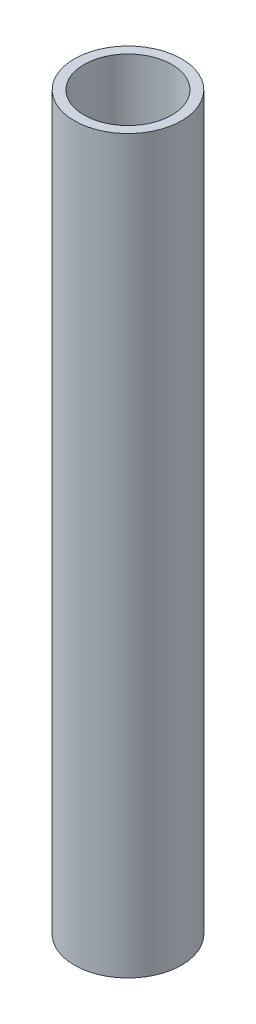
ISO-10303-21;
HEADER;
FILE_DESCRIPTION(('STEP AP214'),'2;1');
FILE_NAME('part.step','',(''),(''),'','','');
FILE_SCHEMA(('AUTOMOTIVE_DESIGN { 1 0 10303 214 1 1 1 1 }'));
ENDSEC;
DATA;
#1=APPLICATION_CONTEXT('core data for automotive mechanical design processes');
#2=APPLICATION_PROTOCOL_DEFINITION('international standard','automotive_design',2000,#1);
#3=PRODUCT_CONTEXT('',#1,'mechanical');
#4=PRODUCT('Part','Part','',(#3));
#5=PRODUCT_RELATED_PRODUCT_CATEGORY('part','',(#4));
#6=PRODUCT_DEFINITION_FORMATION('','',#4);
#7=PRODUCT_DEFINITION_CONTEXT('part definition',#1,'design');
#8=PRODUCT_DEFINITION('design','',#6,#7);
#9=PRODUCT_DEFINITION_SHAPE('','',#8);
#10=(LENGTH_UNIT() NAMED_UNIT(*) SI_UNIT(.MILLI.,.METRE.));
#11=(NAMED_UNIT(*) PLANE_ANGLE_UNIT() SI_UNIT($,.RADIAN.));
#12=(NAMED_UNIT(*) SI_UNIT($,.STERADIAN.) SOLID_ANGLE_UNIT());
#13=UNCERTAINTY_MEASURE_WITH_UNIT(LENGTH_MEASURE(1.E-05),#10,'distance_accuracy_value','');
#14=(GEOMETRIC_REPRESENTATION_CONTEXT(3) GLOBAL_UNCERTAINTY_ASSIGNED_CONTEXT((#13)) GLOBAL_UNIT_ASSIGNED_CONTEXT((#10,
#11,#12)) REPRESENTATION_CONTEXT('',''));
#15=CARTESIAN_POINT('',(0.,0.,0.));
#16=DIRECTION('',(0.,0.,1.));
#17=DIRECTION('',(1.,0.,0.));
#18=AXIS2_PLACEMENT_3D('',#15,#16,#17);
#19=CARTESIAN_POINT('',(0.,0.,0.));
#20=DIRECTION('',(0.,1.,0.));
#21=DIRECTION('',(0.,0.,1.));
#22=AXIS2_PLACEMENT_3D('',#19,#20,#21);
#23=CYLINDRICAL_SURFACE('',#22,8.99999999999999);
#24=CARTESIAN_POINT('',(0.,-174.,0.));
#25=DIRECTION('',(0.,1.,0.));
#26=DIRECTION('',(0.,0.,1.));
#27=AXIS2_PLACEMENT_3D('',#24,#25,#26);
#28=CIRCLE('',#27,8.99999999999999);
#29=CARTESIAN_POINT('',(0.,-174.,8.99999999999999));
#30=VERTEX_POINT('',#29);
#31=EDGE_CURVE('E10',#30,#30,#28,.T.);
#32=ORIENTED_EDGE('',*,*,#31,.F.);
#33=EDGE_LOOP('',(#32));
#34=FACE_BOUND('',#33,.T.);
#35=CARTESIAN_POINT('',(0.,-24.,0.));
#36=DIRECTION('',(0.,1.,0.));
#37=DIRECTION('',(0.,0.,1.));
#38=AXIS2_PLACEMENT_3D('',#35,#36,#37);
#39=CIRCLE('',#38,8.99999999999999);
#40=CARTESIAN_POINT('',(0.,-24.,8.99999999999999));
#41=VERTEX_POINT('',#40);
#42=EDGE_CURVE('E43',#41,#41,#39,.T.);
#43=ORIENTED_EDGE('',*,*,#42,.T.);
#44=EDGE_LOOP('',(#43));
#45=FACE_BOUND('',#44,.T.);
#46=ADVANCED_FACE('F29',(#34,#45),#23,.F.);
#47=CARTESIAN_POINT('',(8.99999999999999,-174.,0.));
#48=DIRECTION('',(0.,1.,0.));
#49=DIRECTION('',(0.,0.,1.));
#50=AXIS2_PLACEMENT_3D('',#47,#48,#49);
#51=PLANE('',#50);
#52=CARTESIAN_POINT('',(0.,-174.,0.));
#53=DIRECTION('',(0.,1.,0.));
#54=DIRECTION('',(0.,0.,1.));
#55=AXIS2_PLACEMENT_3D('',#52,#53,#54);
#56=CIRCLE('',#55,11.);
#57=CARTESIAN_POINT('',(0.,-174.,11.));
#58=VERTEX_POINT('',#57);
#59=EDGE_CURVE('E35',#58,#58,#56,.T.);
#60=ORIENTED_EDGE('',*,*,#59,.F.);
#61=EDGE_LOOP('',(#60));
#62=FACE_BOUND('',#61,.T.);
#63=ORIENTED_EDGE('',*,*,#31,.T.);
#64=EDGE_LOOP('',(#63));
#65=FACE_BOUND('',#64,.T.);
#66=ADVANCED_FACE('F58',(#62,#65),#51,.F.);
#67=CARTESIAN_POINT('',(0.,0.,0.));
#68=DIRECTION('',(0.,1.,0.));
#69=DIRECTION('',(0.,0.,1.));
#70=AXIS2_PLACEMENT_3D('',#67,#68,#69);
#71=CYLINDRICAL_SURFACE('',#70,11.);
#72=CARTESIAN_POINT('',(0.,-24.,0.));
#73=DIRECTION('',(0.,1.,0.));
#74=DIRECTION('',(0.,0.,1.));
#75=AXIS2_PLACEMENT_3D('',#72,#73,#74);
#76=CIRCLE('',#75,11.);
#77=CARTESIAN_POINT('',(0.,-24.,11.));
#78=VERTEX_POINT('',#77);
#79=EDGE_CURVE('E39',#78,#78,#76,.T.);
#80=ORIENTED_EDGE('',*,*,#79,.F.);
#81=EDGE_LOOP('',(#80));
#82=FACE_BOUND('',#81,.T.);
#83=ORIENTED_EDGE('',*,*,#59,.T.);
#84=EDGE_LOOP('',(#83));
#85=FACE_BOUND('',#84,.T.);
#86=ADVANCED_FACE('F53',(#82,#85),#71,.T.);
#87=CARTESIAN_POINT('',(8.99999999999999,-24.,0.));
#88=DIRECTION('',(0.,-1.,0.));
#89=DIRECTION('',(0.,0.,-1.));
#90=AXIS2_PLACEMENT_3D('',#87,#88,#89);
#91=PLANE('',#90);
#92=ORIENTED_EDGE('',*,*,#42,.F.);
#93=EDGE_LOOP('',(#92));
#94=FACE_BOUND('',#93,.T.);
#95=ORIENTED_EDGE('',*,*,#79,.T.);
#96=EDGE_LOOP('',(#95));
#97=FACE_BOUND('',#96,.T.);
#98=ADVANCED_FACE('F50',(#94,#97),#91,.F.);
#99=CLOSED_SHELL('',(#46,#66,#86,#98));
#100=MANIFOLD_SOLID_BREP('B2',#99);
#101=ADVANCED_BREP_SHAPE_REPRESENTATION('',(#18,#100),#14);
#102=SHAPE_DEFINITION_REPRESENTATION(#9,#101);
ENDSEC;
END-ISO-10303-21;
